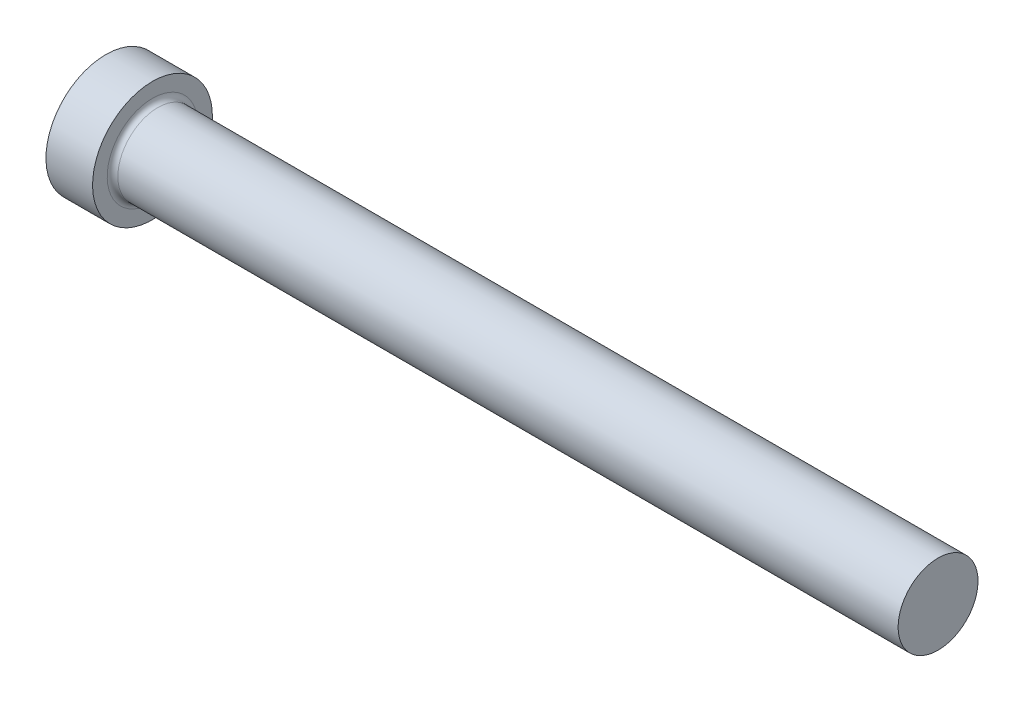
ISO-10303-21;
HEADER;
FILE_DESCRIPTION(('STEP AP214'),'2;1');
FILE_NAME('part.step','',(''),(''),'','','');
FILE_SCHEMA(('AUTOMOTIVE_DESIGN { 1 0 10303 214 1 1 1 1 }'));
ENDSEC;
DATA;
#1=APPLICATION_CONTEXT('core data for automotive mechanical design processes');
#2=APPLICATION_PROTOCOL_DEFINITION('international standard','automotive_design',2000,#1);
#3=PRODUCT_CONTEXT('',#1,'mechanical');
#4=PRODUCT('Part','Part','',(#3));
#5=PRODUCT_RELATED_PRODUCT_CATEGORY('part','',(#4));
#6=PRODUCT_DEFINITION_FORMATION('','',#4);
#7=PRODUCT_DEFINITION_CONTEXT('part definition',#1,'design');
#8=PRODUCT_DEFINITION('design','',#6,#7);
#9=PRODUCT_DEFINITION_SHAPE('','',#8);
#10=(LENGTH_UNIT() NAMED_UNIT(*) SI_UNIT(.MILLI.,.METRE.));
#11=(NAMED_UNIT(*) PLANE_ANGLE_UNIT() SI_UNIT($,.RADIAN.));
#12=(NAMED_UNIT(*) SI_UNIT($,.STERADIAN.) SOLID_ANGLE_UNIT());
#13=UNCERTAINTY_MEASURE_WITH_UNIT(LENGTH_MEASURE(1.E-05),#10,'distance_accuracy_value','');
#14=(GEOMETRIC_REPRESENTATION_CONTEXT(3) GLOBAL_UNCERTAINTY_ASSIGNED_CONTEXT((#13)) GLOBAL_UNIT_ASSIGNED_CONTEXT((#10,
#11,#12)) REPRESENTATION_CONTEXT('',''));
#15=CARTESIAN_POINT('',(0.,0.,0.));
#16=DIRECTION('',(0.,0.,1.));
#17=DIRECTION('',(1.,0.,0.));
#18=AXIS2_PLACEMENT_3D('',#15,#16,#17);
#19=CARTESIAN_POINT('',(0.,0.,0.));
#20=DIRECTION('',(-1.,0.,0.));
#21=DIRECTION('',(0.,-1.,0.));
#22=AXIS2_PLACEMENT_3D('',#19,#20,#21);
#23=PLANE('',#22);
#24=CARTESIAN_POINT('',(0.,0.,0.));
#25=DIRECTION('',(1.,0.,0.));
#26=DIRECTION('',(0.,1.,0.));
#27=AXIS2_PLACEMENT_3D('',#24,#25,#26);
#28=CIRCLE('',#27,9.);
#29=CARTESIAN_POINT('',(0.,9.,0.));
#30=VERTEX_POINT('',#29);
#31=EDGE_CURVE('E25',#30,#30,#28,.T.);
#32=ORIENTED_EDGE('',*,*,#31,.F.);
#33=EDGE_LOOP('',(#32));
#34=FACE_BOUND('',#33,.T.);
#35=ADVANCED_FACE('F14',(#34),#23,.T.);
#36=CARTESIAN_POINT('',(125.,-1.07156594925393E-13,0.));
#37=DIRECTION('',(1.,0.,0.));
#38=DIRECTION('',(0.,1.,0.));
#39=AXIS2_PLACEMENT_3D('',#36,#37,#38);
#40=CYLINDRICAL_SURFACE('',#39,9.);
#41=ORIENTED_EDGE('',*,*,#31,.T.);
#42=EDGE_LOOP('',(#41));
#43=FACE_BOUND('',#42,.T.);
#44=CARTESIAN_POINT('',(7.,0.,0.));
#45=DIRECTION('',(1.,0.,0.));
#46=DIRECTION('',(0.,1.,0.));
#47=AXIS2_PLACEMENT_3D('',#44,#45,#46);
#48=CIRCLE('',#47,9.);
#49=CARTESIAN_POINT('',(7.00000000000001,8.99999999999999,0.));
#50=VERTEX_POINT('',#49);
#51=EDGE_CURVE('E29',#50,#50,#48,.T.);
#52=ORIENTED_EDGE('',*,*,#51,.F.);
#53=EDGE_LOOP('',(#52));
#54=FACE_BOUND('',#53,.T.);
#55=ADVANCED_FACE('F51',(#43,#54),#40,.T.);
#56=CARTESIAN_POINT('',(7.,9.,0.));
#57=DIRECTION('',(1.,0.,0.));
#58=DIRECTION('',(0.,1.,0.));
#59=AXIS2_PLACEMENT_3D('',#56,#57,#58);
#60=PLANE('',#59);
#61=CARTESIAN_POINT('',(7.,0.,0.));
#62=DIRECTION('',(1.,0.,0.));
#63=DIRECTION('',(0.,1.,0.));
#64=AXIS2_PLACEMENT_3D('',#61,#62,#63);
#65=CIRCLE('',#64,6.8);
#66=CARTESIAN_POINT('',(7.00000000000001,6.79999999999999,0.));
#67=VERTEX_POINT('',#66);
#68=EDGE_CURVE('E9',#67,#67,#65,.F.);
#69=ORIENTED_EDGE('',*,*,#68,.T.);
#70=EDGE_LOOP('',(#69));
#71=FACE_BOUND('',#70,.T.);
#72=ORIENTED_EDGE('',*,*,#51,.T.);
#73=EDGE_LOOP('',(#72));
#74=FACE_BOUND('',#73,.T.);
#75=ADVANCED_FACE('F42',(#71,#74),#60,.T.);
#76=CARTESIAN_POINT('',(125.,-1.07156594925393E-13,0.));
#77=DIRECTION('',(1.,0.,0.));
#78=DIRECTION('',(0.,1.,0.));
#79=AXIS2_PLACEMENT_3D('',#76,#77,#78);
#80=CYLINDRICAL_SURFACE('',#79,6.);
#81=CARTESIAN_POINT('',(7.8,0.,0.));
#82=DIRECTION('',(1.,0.,0.));
#83=DIRECTION('',(0.,1.,0.));
#84=AXIS2_PLACEMENT_3D('',#81,#82,#83);
#85=CIRCLE('',#84,6.);
#86=CARTESIAN_POINT('',(7.80000000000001,5.99999999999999,0.));
#87=VERTEX_POINT('',#86);
#88=EDGE_CURVE('E21',#87,#87,#85,.T.);
#89=ORIENTED_EDGE('',*,*,#88,.T.);
#90=EDGE_LOOP('',(#89));
#91=FACE_BOUND('',#90,.T.);
#92=CARTESIAN_POINT('',(125.,-1.07156594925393E-13,0.));
#93=DIRECTION('',(1.,0.,0.));
#94=DIRECTION('',(0.,1.,0.));
#95=AXIS2_PLACEMENT_3D('',#92,#93,#94);
#96=CIRCLE('',#95,6.);
#97=CARTESIAN_POINT('',(125.,5.99999999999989,0.));
#98=VERTEX_POINT('',#97);
#99=EDGE_CURVE('E34',#98,#98,#96,.T.);
#100=ORIENTED_EDGE('',*,*,#99,.F.);
#101=EDGE_LOOP('',(#100));
#102=FACE_BOUND('',#101,.T.);
#103=ADVANCED_FACE('F40',(#91,#102),#80,.T.);
#104=CARTESIAN_POINT('',(125.,5.99999999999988,0.));
#105=DIRECTION('',(1.,0.,0.));
#106=DIRECTION('',(0.,1.,0.));
#107=AXIS2_PLACEMENT_3D('',#104,#105,#106);
#108=PLANE('',#107);
#109=ORIENTED_EDGE('',*,*,#99,.T.);
#110=EDGE_LOOP('',(#109));
#111=FACE_BOUND('',#110,.T.);
#112=ADVANCED_FACE('F38',(#111),#108,.T.);
#113=CARTESIAN_POINT('',(7.8,0.,0.));
#114=DIRECTION('',(1.,0.,0.));
#115=DIRECTION('',(0.,1.,0.));
#116=AXIS2_PLACEMENT_3D('',#113,#114,#115);
#117=TOROIDAL_SURFACE('',#116,6.8,0.8);
#118=ORIENTED_EDGE('',*,*,#68,.F.);
#119=EDGE_LOOP('',(#118));
#120=FACE_BOUND('',#119,.T.);
#121=ORIENTED_EDGE('',*,*,#88,.F.);
#122=EDGE_LOOP('',(#121));
#123=FACE_BOUND('',#122,.T.);
#124=ADVANCED_FACE('F16',(#120,#123),#117,.F.);
#125=CLOSED_SHELL('',(#35,#55,#75,#103,#112,#124));
#126=MANIFOLD_SOLID_BREP('B1',#125);
#127=ADVANCED_BREP_SHAPE_REPRESENTATION('',(#18,#126),#14);
#128=SHAPE_DEFINITION_REPRESENTATION(#9,#127);
ENDSEC;
END-ISO-10303-21;
